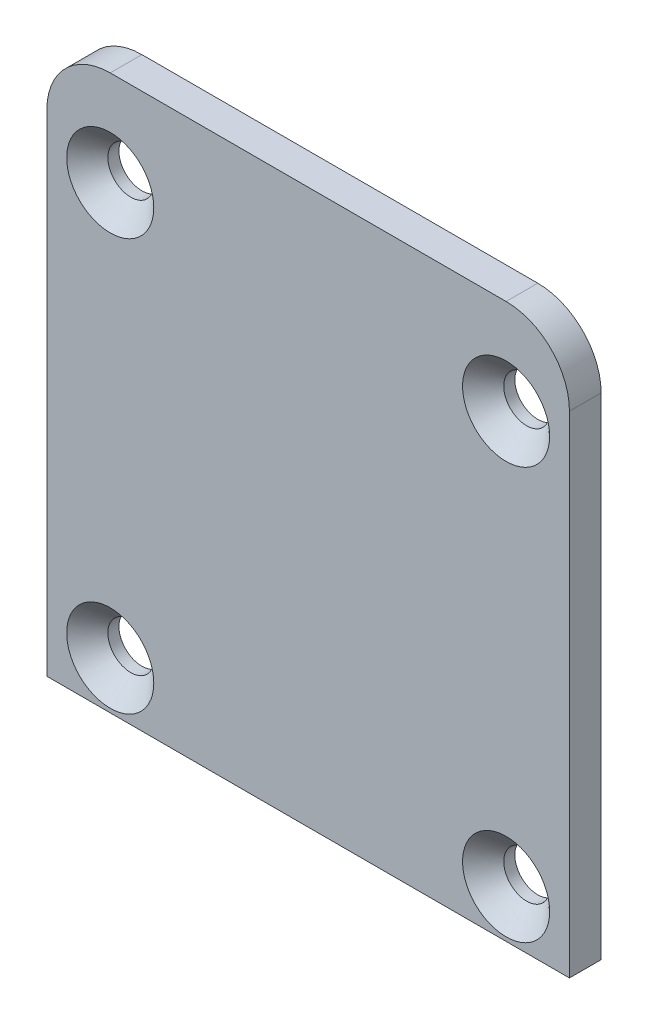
ISO-10303-21;
HEADER;
FILE_DESCRIPTION(('STEP AP214'),'2;1');
FILE_NAME('part.step','',(''),(''),'','','');
FILE_SCHEMA(('AUTOMOTIVE_DESIGN { 1 0 10303 214 1 1 1 1 }'));
ENDSEC;
DATA;
#1=APPLICATION_CONTEXT('core data for automotive mechanical design processes');
#2=APPLICATION_PROTOCOL_DEFINITION('international standard','automotive_design',2000,#1);
#3=PRODUCT_CONTEXT('',#1,'mechanical');
#4=PRODUCT('Part','Part','',(#3));
#5=PRODUCT_RELATED_PRODUCT_CATEGORY('part','',(#4));
#6=PRODUCT_DEFINITION_FORMATION('','',#4);
#7=PRODUCT_DEFINITION_CONTEXT('part definition',#1,'design');
#8=PRODUCT_DEFINITION('design','',#6,#7);
#9=PRODUCT_DEFINITION_SHAPE('','',#8);
#10=(LENGTH_UNIT() NAMED_UNIT(*) SI_UNIT(.MILLI.,.METRE.));
#11=(NAMED_UNIT(*) PLANE_ANGLE_UNIT() SI_UNIT($,.RADIAN.));
#12=(NAMED_UNIT(*) SI_UNIT($,.STERADIAN.) SOLID_ANGLE_UNIT());
#13=UNCERTAINTY_MEASURE_WITH_UNIT(LENGTH_MEASURE(1.E-05),#10,'distance_accuracy_value','');
#14=(GEOMETRIC_REPRESENTATION_CONTEXT(3) GLOBAL_UNCERTAINTY_ASSIGNED_CONTEXT((#13)) GLOBAL_UNIT_ASSIGNED_CONTEXT((#10,
#11,#12)) REPRESENTATION_CONTEXT('',''));
#15=CARTESIAN_POINT('',(0.,0.,0.));
#16=DIRECTION('',(0.,0.,1.));
#17=DIRECTION('',(1.,0.,0.));
#18=AXIS2_PLACEMENT_3D('',#15,#16,#17);
#19=CARTESIAN_POINT('',(-12.5,14.0000000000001,0.));
#20=DIRECTION('',(0.,0.,-1.));
#21=DIRECTION('',(-1.,0.,0.));
#22=AXIS2_PLACEMENT_3D('',#19,#20,#21);
#23=PLANE('',#22);
#24=CARTESIAN_POINT('',(-12.5,-14.,0.));
#25=DIRECTION('',(0.,0.,1.));
#26=DIRECTION('',(1.,0.,0.));
#27=AXIS2_PLACEMENT_3D('',#24,#25,#26);
#28=CIRCLE('',#27,1.45);
#29=CARTESIAN_POINT('',(-11.05,-14.,0.));
#30=VERTEX_POINT('',#29);
#31=EDGE_CURVE('E196',#30,#30,#28,.T.);
#32=ORIENTED_EDGE('',*,*,#31,.T.);
#33=EDGE_LOOP('',(#32));
#34=FACE_BOUND('',#33,.T.);
#35=CARTESIAN_POINT('',(12.5,-14.,0.));
#36=DIRECTION('',(0.,0.,1.));
#37=DIRECTION('',(1.,0.,0.));
#38=AXIS2_PLACEMENT_3D('',#35,#36,#37);
#39=CIRCLE('',#38,1.45);
#40=CARTESIAN_POINT('',(13.95,-14.,0.));
#41=VERTEX_POINT('',#40);
#42=EDGE_CURVE('E203',#41,#41,#39,.T.);
#43=ORIENTED_EDGE('',*,*,#42,.T.);
#44=EDGE_LOOP('',(#43));
#45=FACE_BOUND('',#44,.T.);
#46=CARTESIAN_POINT('',(12.5,12.,0.));
#47=DIRECTION('',(0.,0.,1.));
#48=DIRECTION('',(1.,0.,0.));
#49=AXIS2_PLACEMENT_3D('',#46,#47,#48);
#50=CIRCLE('',#49,1.45);
#51=CARTESIAN_POINT('',(13.95,12.,0.));
#52=VERTEX_POINT('',#51);
#53=EDGE_CURVE('E215',#52,#52,#50,.T.);
#54=ORIENTED_EDGE('',*,*,#53,.T.);
#55=EDGE_LOOP('',(#54));
#56=FACE_BOUND('',#55,.T.);
#57=DIRECTION('',(0.,1.,0.));
#58=VECTOR('',#57,1.);
#59=CARTESIAN_POINT('',(16.5,14.,0.));
#60=LINE('',#59,#58);
#61=CARTESIAN_POINT('',(16.5,-17.,0.));
#62=VERTEX_POINT('',#61);
#63=CARTESIAN_POINT('',(16.5,14.,0.));
#64=VERTEX_POINT('',#63);
#65=EDGE_CURVE('E117',#62,#64,#60,.T.);
#66=ORIENTED_EDGE('',*,*,#65,.F.);
#67=DIRECTION('',(1.,0.,0.));
#68=VECTOR('',#67,1.);
#69=CARTESIAN_POINT('',(-16.5,-17.,0.));
#70=LINE('',#69,#68);
#71=CARTESIAN_POINT('',(-16.5,-17.,0.));
#72=VERTEX_POINT('',#71);
#73=EDGE_CURVE('E78',#72,#62,#70,.T.);
#74=ORIENTED_EDGE('',*,*,#73,.F.);
#75=DIRECTION('',(0.,-1.,0.));
#76=VECTOR('',#75,1.);
#77=CARTESIAN_POINT('',(-16.5,14.0000000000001,0.));
#78=LINE('',#77,#76);
#79=CARTESIAN_POINT('',(-16.5,14.0000000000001,0.));
#80=VERTEX_POINT('',#79);
#81=EDGE_CURVE('E72',#80,#72,#78,.T.);
#82=ORIENTED_EDGE('',*,*,#81,.F.);
#83=CARTESIAN_POINT('',(-12.5,14.0000000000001,0.));
#84=DIRECTION('',(0.,0.,1.));
#85=DIRECTION('',(-1.,0.,0.));
#86=AXIS2_PLACEMENT_3D('',#83,#84,#85);
#87=CIRCLE('',#86,4.);
#88=CARTESIAN_POINT('',(-12.5,18.0000000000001,0.));
#89=VERTEX_POINT('',#88);
#90=EDGE_CURVE('E107',#89,#80,#87,.T.);
#91=ORIENTED_EDGE('',*,*,#90,.F.);
#92=DIRECTION('',(-1.,0.,0.));
#93=VECTOR('',#92,1.);
#94=CARTESIAN_POINT('',(-12.5,18.0000000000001,0.));
#95=LINE('',#94,#93);
#96=CARTESIAN_POINT('',(12.5,18.,0.));
#97=VERTEX_POINT('',#96);
#98=EDGE_CURVE('E123',#97,#89,#95,.T.);
#99=ORIENTED_EDGE('',*,*,#98,.F.);
#100=CARTESIAN_POINT('',(12.5,14.,0.));
#101=DIRECTION('',(0.,0.,1.));
#102=DIRECTION('',(-1.,0.,0.));
#103=AXIS2_PLACEMENT_3D('',#100,#101,#102);
#104=CIRCLE('',#103,4.);
#105=EDGE_CURVE('E120',#64,#97,#104,.T.);
#106=ORIENTED_EDGE('',*,*,#105,.F.);
#107=EDGE_LOOP('',(#66,#74,#82,#91,#99,#106));
#108=FACE_BOUND('',#107,.T.);
#109=CARTESIAN_POINT('',(-12.5,12.0000000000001,0.));
#110=DIRECTION('',(0.,0.,1.));
#111=DIRECTION('',(1.,0.,0.));
#112=AXIS2_PLACEMENT_3D('',#109,#110,#111);
#113=CIRCLE('',#112,1.45);
#114=CARTESIAN_POINT('',(-11.05,12.0000000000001,0.));
#115=VERTEX_POINT('',#114);
#116=EDGE_CURVE('E224',#115,#115,#113,.T.);
#117=ORIENTED_EDGE('',*,*,#116,.T.);
#118=EDGE_LOOP('',(#117));
#119=FACE_BOUND('',#118,.T.);
#120=ADVANCED_FACE('F32',(#34,#45,#56,#108,#119),#23,.T.);
#121=CARTESIAN_POINT('',(16.5,13.9999999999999,2.00000000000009));
#122=DIRECTION('',(-1.,0.,0.));
#123=DIRECTION('',(0.,-1.,0.));
#124=AXIS2_PLACEMENT_3D('',#121,#122,#123);
#125=PLANE('',#124);
#126=ORIENTED_EDGE('',*,*,#65,.T.);
#127=DIRECTION('',(0.,0.,-1.));
#128=VECTOR('',#127,1.);
#129=CARTESIAN_POINT('',(16.5,13.9999999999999,2.00000000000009));
#130=LINE('',#129,#128);
#131=CARTESIAN_POINT('',(16.5,13.9999999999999,2.00000000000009));
#132=VERTEX_POINT('',#131);
#133=EDGE_CURVE('E11',#132,#64,#130,.T.);
#134=ORIENTED_EDGE('',*,*,#133,.F.);
#135=DIRECTION('',(0.,1.,0.));
#136=VECTOR('',#135,1.);
#137=CARTESIAN_POINT('',(16.5,13.9999999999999,2.00000000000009));
#138=LINE('',#137,#136);
#139=CARTESIAN_POINT('',(16.5,-17.,2.));
#140=VERTEX_POINT('',#139);
#141=EDGE_CURVE('E128',#140,#132,#138,.T.);
#142=ORIENTED_EDGE('',*,*,#141,.F.);
#143=DIRECTION('',(0.,0.,-1.));
#144=VECTOR('',#143,1.);
#145=CARTESIAN_POINT('',(16.5,-17.,2.));
#146=LINE('',#145,#144);
#147=EDGE_CURVE('E113',#140,#62,#146,.T.);
#148=ORIENTED_EDGE('',*,*,#147,.T.);
#149=EDGE_LOOP('',(#126,#134,#142,#148));
#150=FACE_BOUND('',#149,.T.);
#151=ADVANCED_FACE('F34',(#150),#125,.F.);
#152=CARTESIAN_POINT('',(12.5,13.9999999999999,2.00000000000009));
#153=DIRECTION('',(0.,0.,-1.));
#154=DIRECTION('',(-1.,0.,0.));
#155=AXIS2_PLACEMENT_3D('',#152,#153,#154);
#156=CYLINDRICAL_SURFACE('',#155,4.);
#157=ORIENTED_EDGE('',*,*,#105,.T.);
#158=DIRECTION('',(0.,0.,-1.));
#159=VECTOR('',#158,1.);
#160=CARTESIAN_POINT('',(12.5,17.9999999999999,2.00000000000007));
#161=LINE('',#160,#159);
#162=CARTESIAN_POINT('',(12.5,17.9999999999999,2.00000000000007));
#163=VERTEX_POINT('',#162);
#164=EDGE_CURVE('E41',#163,#97,#161,.T.);
#165=ORIENTED_EDGE('',*,*,#164,.F.);
#166=CARTESIAN_POINT('',(12.5,13.9999999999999,2.00000000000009));
#167=DIRECTION('',(0.,0.,1.));
#168=DIRECTION('',(-1.,0.,0.));
#169=AXIS2_PLACEMENT_3D('',#166,#167,#168);
#170=CIRCLE('',#169,4.);
#171=EDGE_CURVE('E86',#132,#163,#170,.T.);
#172=ORIENTED_EDGE('',*,*,#171,.F.);
#173=ORIENTED_EDGE('',*,*,#133,.T.);
#174=EDGE_LOOP('',(#157,#165,#172,#173));
#175=FACE_BOUND('',#174,.T.);
#176=ADVANCED_FACE('F158',(#175),#156,.T.);
#177=CARTESIAN_POINT('',(-12.5,18.,2.));
#178=DIRECTION('',(0.,-1.,0.));
#179=DIRECTION('',(0.,0.,-1.));
#180=AXIS2_PLACEMENT_3D('',#177,#178,#179);
#181=PLANE('',#180);
#182=ORIENTED_EDGE('',*,*,#98,.T.);
#183=DIRECTION('',(0.,0.,-1.));
#184=VECTOR('',#183,1.);
#185=CARTESIAN_POINT('',(-12.5,18.,2.));
#186=LINE('',#185,#184);
#187=CARTESIAN_POINT('',(-12.5,18.,2.));
#188=VERTEX_POINT('',#187);
#189=EDGE_CURVE('E108',#188,#89,#186,.T.);
#190=ORIENTED_EDGE('',*,*,#189,.F.);
#191=DIRECTION('',(-1.,0.,0.));
#192=VECTOR('',#191,1.);
#193=CARTESIAN_POINT('',(-12.5,18.,2.));
#194=LINE('',#193,#192);
#195=EDGE_CURVE('E99',#163,#188,#194,.T.);
#196=ORIENTED_EDGE('',*,*,#195,.F.);
#197=ORIENTED_EDGE('',*,*,#164,.T.);
#198=EDGE_LOOP('',(#182,#190,#196,#197));
#199=FACE_BOUND('',#198,.T.);
#200=ADVANCED_FACE('F134',(#199),#181,.F.);
#201=CARTESIAN_POINT('',(-12.5,14.,2.));
#202=DIRECTION('',(0.,0.,-1.));
#203=DIRECTION('',(-1.,0.,0.));
#204=AXIS2_PLACEMENT_3D('',#201,#202,#203);
#205=CYLINDRICAL_SURFACE('',#204,4.);
#206=ORIENTED_EDGE('',*,*,#90,.T.);
#207=DIRECTION('',(0.,0.,-1.));
#208=VECTOR('',#207,1.);
#209=CARTESIAN_POINT('',(-16.5,14.,2.));
#210=LINE('',#209,#208);
#211=CARTESIAN_POINT('',(-16.5,14.,2.));
#212=VERTEX_POINT('',#211);
#213=EDGE_CURVE('E104',#212,#80,#210,.T.);
#214=ORIENTED_EDGE('',*,*,#213,.F.);
#215=CARTESIAN_POINT('',(-12.5,14.,2.));
#216=DIRECTION('',(0.,0.,1.));
#217=DIRECTION('',(-1.,0.,0.));
#218=AXIS2_PLACEMENT_3D('',#215,#216,#217);
#219=CIRCLE('',#218,4.);
#220=EDGE_CURVE('E93',#188,#212,#219,.T.);
#221=ORIENTED_EDGE('',*,*,#220,.F.);
#222=ORIENTED_EDGE('',*,*,#189,.T.);
#223=EDGE_LOOP('',(#206,#214,#221,#222));
#224=FACE_BOUND('',#223,.T.);
#225=ADVANCED_FACE('F105',(#224),#205,.T.);
#226=CARTESIAN_POINT('',(-16.5,14.,2.));
#227=DIRECTION('',(1.,0.,0.));
#228=DIRECTION('',(0.,1.,0.));
#229=AXIS2_PLACEMENT_3D('',#226,#227,#228);
#230=PLANE('',#229);
#231=ORIENTED_EDGE('',*,*,#81,.T.);
#232=DIRECTION('',(0.,0.,-1.));
#233=VECTOR('',#232,1.);
#234=CARTESIAN_POINT('',(-16.5,-17.,1.99999999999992));
#235=LINE('',#234,#233);
#236=CARTESIAN_POINT('',(-16.5,-17.,1.99999999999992));
#237=VERTEX_POINT('',#236);
#238=EDGE_CURVE('E109',#237,#72,#235,.T.);
#239=ORIENTED_EDGE('',*,*,#238,.F.);
#240=DIRECTION('',(0.,-1.,0.));
#241=VECTOR('',#240,1.);
#242=CARTESIAN_POINT('',(-16.5,14.,2.));
#243=LINE('',#242,#241);
#244=EDGE_CURVE('E97',#212,#237,#243,.T.);
#245=ORIENTED_EDGE('',*,*,#244,.F.);
#246=ORIENTED_EDGE('',*,*,#213,.T.);
#247=EDGE_LOOP('',(#231,#239,#245,#246));
#248=FACE_BOUND('',#247,.T.);
#249=ADVANCED_FACE('F111',(#248),#230,.F.);
#250=CARTESIAN_POINT('',(-16.5,-17.,1.99999999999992));
#251=DIRECTION('',(0.,1.,0.));
#252=DIRECTION('',(0.,0.,1.));
#253=AXIS2_PLACEMENT_3D('',#250,#251,#252);
#254=PLANE('',#253);
#255=ORIENTED_EDGE('',*,*,#73,.T.);
#256=ORIENTED_EDGE('',*,*,#147,.F.);
#257=DIRECTION('',(1.,0.,0.));
#258=VECTOR('',#257,1.);
#259=CARTESIAN_POINT('',(-16.5,-17.,1.99999999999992));
#260=LINE('',#259,#258);
#261=EDGE_CURVE('E49',#237,#140,#260,.T.);
#262=ORIENTED_EDGE('',*,*,#261,.F.);
#263=ORIENTED_EDGE('',*,*,#238,.T.);
#264=EDGE_LOOP('',(#255,#256,#262,#263));
#265=FACE_BOUND('',#264,.T.);
#266=ADVANCED_FACE('F141',(#265),#254,.F.);
#267=CARTESIAN_POINT('',(-12.5,14.,2.));
#268=DIRECTION('',(0.,0.,-1.));
#269=DIRECTION('',(-1.,0.,0.));
#270=AXIS2_PLACEMENT_3D('',#267,#268,#269);
#271=PLANE('',#270);
#272=CARTESIAN_POINT('',(-12.5,-14.,2.));
#273=DIRECTION('',(0.,0.,1.));
#274=DIRECTION('',(1.,0.,0.));
#275=AXIS2_PLACEMENT_3D('',#272,#273,#274);
#276=CIRCLE('',#275,2.75);
#277=CARTESIAN_POINT('',(-9.74999999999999,-14.,2.));
#278=VERTEX_POINT('',#277);
#279=EDGE_CURVE('E200',#278,#278,#276,.T.);
#280=ORIENTED_EDGE('',*,*,#279,.F.);
#281=EDGE_LOOP('',(#280));
#282=FACE_BOUND('',#281,.T.);
#283=CARTESIAN_POINT('',(12.5,-14.,2.00000000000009));
#284=DIRECTION('',(0.,0.,1.));
#285=DIRECTION('',(1.,0.,0.));
#286=AXIS2_PLACEMENT_3D('',#283,#284,#285);
#287=CIRCLE('',#286,2.75);
#288=CARTESIAN_POINT('',(15.25,-14.,2.00000000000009));
#289=VERTEX_POINT('',#288);
#290=EDGE_CURVE('E212',#289,#289,#287,.T.);
#291=ORIENTED_EDGE('',*,*,#290,.F.);
#292=EDGE_LOOP('',(#291));
#293=FACE_BOUND('',#292,.T.);
#294=CARTESIAN_POINT('',(12.5,11.9999999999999,2.00000000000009));
#295=DIRECTION('',(0.,0.,1.));
#296=DIRECTION('',(1.,0.,0.));
#297=AXIS2_PLACEMENT_3D('',#294,#295,#296);
#298=CIRCLE('',#297,2.75);
#299=CARTESIAN_POINT('',(15.25,11.9999999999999,2.00000000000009));
#300=VERTEX_POINT('',#299);
#301=EDGE_CURVE('E221',#300,#300,#298,.T.);
#302=ORIENTED_EDGE('',*,*,#301,.F.);
#303=EDGE_LOOP('',(#302));
#304=FACE_BOUND('',#303,.T.);
#305=CARTESIAN_POINT('',(-12.5,12.,2.));
#306=DIRECTION('',(0.,0.,1.));
#307=DIRECTION('',(1.,0.,0.));
#308=AXIS2_PLACEMENT_3D('',#305,#306,#307);
#309=CIRCLE('',#308,2.75);
#310=CARTESIAN_POINT('',(-9.74999999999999,12.,2.));
#311=VERTEX_POINT('',#310);
#312=EDGE_CURVE('E121',#311,#311,#309,.T.);
#313=ORIENTED_EDGE('',*,*,#312,.F.);
#314=EDGE_LOOP('',(#313));
#315=FACE_BOUND('',#314,.T.);
#316=ORIENTED_EDGE('',*,*,#141,.T.);
#317=ORIENTED_EDGE('',*,*,#171,.T.);
#318=ORIENTED_EDGE('',*,*,#195,.T.);
#319=ORIENTED_EDGE('',*,*,#220,.T.);
#320=ORIENTED_EDGE('',*,*,#244,.T.);
#321=ORIENTED_EDGE('',*,*,#261,.T.);
#322=EDGE_LOOP('',(#316,#317,#318,#319,#320,#321));
#323=FACE_BOUND('',#322,.T.);
#324=ADVANCED_FACE('F95',(#282,#293,#304,#315,#323),#271,.F.);
#325=CARTESIAN_POINT('',(-12.5,12.,2.));
#326=DIRECTION('',(0.,0.,1.));
#327=DIRECTION('',(1.,0.,0.));
#328=AXIS2_PLACEMENT_3D('',#325,#326,#327);
#329=CONICAL_SURFACE('',#328,2.75,0.785398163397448);
#330=CARTESIAN_POINT('',(-12.5,12.0000000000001,0.700000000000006));
#331=DIRECTION('',(0.,0.,1.));
#332=DIRECTION('',(1.,0.,0.));
#333=AXIS2_PLACEMENT_3D('',#330,#331,#332);
#334=CIRCLE('',#333,1.45);
#335=CARTESIAN_POINT('',(-11.05,12.0000000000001,0.700000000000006));
#336=VERTEX_POINT('',#335);
#337=EDGE_CURVE('E227',#336,#336,#334,.T.);
#338=ORIENTED_EDGE('',*,*,#337,.F.);
#339=EDGE_LOOP('',(#338));
#340=FACE_BOUND('',#339,.T.);
#341=ORIENTED_EDGE('',*,*,#312,.T.);
#342=EDGE_LOOP('',(#341));
#343=FACE_BOUND('',#342,.T.);
#344=ADVANCED_FACE('F148',(#340,#343),#329,.F.);
#345=CARTESIAN_POINT('',(-12.5,12.,2.));
#346=DIRECTION('',(0.,0.,1.));
#347=DIRECTION('',(1.,0.,0.));
#348=AXIS2_PLACEMENT_3D('',#345,#346,#347);
#349=CYLINDRICAL_SURFACE('',#348,1.45);
#350=ORIENTED_EDGE('',*,*,#116,.F.);
#351=EDGE_LOOP('',(#350));
#352=FACE_BOUND('',#351,.T.);
#353=ORIENTED_EDGE('',*,*,#337,.T.);
#354=EDGE_LOOP('',(#353));
#355=FACE_BOUND('',#354,.T.);
#356=ADVANCED_FACE('F164',(#352,#355),#349,.F.);
#357=CARTESIAN_POINT('',(12.5,11.9999999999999,2.00000000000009));
#358=DIRECTION('',(0.,0.,1.));
#359=DIRECTION('',(1.,0.,0.));
#360=AXIS2_PLACEMENT_3D('',#357,#358,#359);
#361=CONICAL_SURFACE('',#360,2.75,0.785398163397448);
#362=CARTESIAN_POINT('',(12.5,12.,0.700000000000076));
#363=DIRECTION('',(0.,0.,1.));
#364=DIRECTION('',(1.,0.,0.));
#365=AXIS2_PLACEMENT_3D('',#362,#363,#364);
#366=CIRCLE('',#365,1.45);
#367=CARTESIAN_POINT('',(13.95,12.,0.700000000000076));
#368=VERTEX_POINT('',#367);
#369=EDGE_CURVE('E218',#368,#368,#366,.T.);
#370=ORIENTED_EDGE('',*,*,#369,.F.);
#371=EDGE_LOOP('',(#370));
#372=FACE_BOUND('',#371,.T.);
#373=ORIENTED_EDGE('',*,*,#301,.T.);
#374=EDGE_LOOP('',(#373));
#375=FACE_BOUND('',#374,.T.);
#376=ADVANCED_FACE('F168',(#372,#375),#361,.F.);
#377=CARTESIAN_POINT('',(12.5,11.9999999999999,2.00000000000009));
#378=DIRECTION('',(0.,0.,1.));
#379=DIRECTION('',(1.,0.,0.));
#380=AXIS2_PLACEMENT_3D('',#377,#378,#379);
#381=CYLINDRICAL_SURFACE('',#380,1.45);
#382=ORIENTED_EDGE('',*,*,#53,.F.);
#383=EDGE_LOOP('',(#382));
#384=FACE_BOUND('',#383,.T.);
#385=ORIENTED_EDGE('',*,*,#369,.T.);
#386=EDGE_LOOP('',(#385));
#387=FACE_BOUND('',#386,.T.);
#388=ADVANCED_FACE('F172',(#384,#387),#381,.F.);
#389=CARTESIAN_POINT('',(12.5,-14.,2.00000000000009));
#390=DIRECTION('',(0.,0.,1.));
#391=DIRECTION('',(1.,0.,0.));
#392=AXIS2_PLACEMENT_3D('',#389,#390,#391);
#393=CONICAL_SURFACE('',#392,2.75,0.785398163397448);
#394=CARTESIAN_POINT('',(12.5,-14.,0.700000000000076));
#395=DIRECTION('',(0.,0.,1.));
#396=DIRECTION('',(1.,0.,0.));
#397=AXIS2_PLACEMENT_3D('',#394,#395,#396);
#398=CIRCLE('',#397,1.45);
#399=CARTESIAN_POINT('',(13.95,-14.,0.700000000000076));
#400=VERTEX_POINT('',#399);
#401=EDGE_CURVE('E209',#400,#400,#398,.T.);
#402=ORIENTED_EDGE('',*,*,#401,.F.);
#403=EDGE_LOOP('',(#402));
#404=FACE_BOUND('',#403,.T.);
#405=ORIENTED_EDGE('',*,*,#290,.T.);
#406=EDGE_LOOP('',(#405));
#407=FACE_BOUND('',#406,.T.);
#408=ADVANCED_FACE('F176',(#404,#407),#393,.F.);
#409=CARTESIAN_POINT('',(12.5,-14.,2.00000000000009));
#410=DIRECTION('',(0.,0.,1.));
#411=DIRECTION('',(1.,0.,0.));
#412=AXIS2_PLACEMENT_3D('',#409,#410,#411);
#413=CYLINDRICAL_SURFACE('',#412,1.45);
#414=ORIENTED_EDGE('',*,*,#42,.F.);
#415=EDGE_LOOP('',(#414));
#416=FACE_BOUND('',#415,.T.);
#417=ORIENTED_EDGE('',*,*,#401,.T.);
#418=EDGE_LOOP('',(#417));
#419=FACE_BOUND('',#418,.T.);
#420=ADVANCED_FACE('F180',(#416,#419),#413,.F.);
#421=CARTESIAN_POINT('',(-12.5,-14.,2.));
#422=DIRECTION('',(0.,0.,1.));
#423=DIRECTION('',(1.,0.,0.));
#424=AXIS2_PLACEMENT_3D('',#421,#422,#423);
#425=CONICAL_SURFACE('',#424,2.75,0.785398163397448);
#426=CARTESIAN_POINT('',(-12.5,-14.,0.700000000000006));
#427=DIRECTION('',(0.,0.,1.));
#428=DIRECTION('',(1.,0.,0.));
#429=AXIS2_PLACEMENT_3D('',#426,#427,#428);
#430=CIRCLE('',#429,1.45);
#431=CARTESIAN_POINT('',(-11.05,-14.,0.700000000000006));
#432=VERTEX_POINT('',#431);
#433=EDGE_CURVE('E199',#432,#432,#430,.T.);
#434=ORIENTED_EDGE('',*,*,#433,.F.);
#435=EDGE_LOOP('',(#434));
#436=FACE_BOUND('',#435,.T.);
#437=ORIENTED_EDGE('',*,*,#279,.T.);
#438=EDGE_LOOP('',(#437));
#439=FACE_BOUND('',#438,.T.);
#440=ADVANCED_FACE('F184',(#436,#439),#425,.F.);
#441=CARTESIAN_POINT('',(-12.5,-14.,2.));
#442=DIRECTION('',(0.,0.,1.));
#443=DIRECTION('',(1.,0.,0.));
#444=AXIS2_PLACEMENT_3D('',#441,#442,#443);
#445=CYLINDRICAL_SURFACE('',#444,1.45);
#446=ORIENTED_EDGE('',*,*,#31,.F.);
#447=EDGE_LOOP('',(#446));
#448=FACE_BOUND('',#447,.T.);
#449=ORIENTED_EDGE('',*,*,#433,.T.);
#450=EDGE_LOOP('',(#449));
#451=FACE_BOUND('',#450,.T.);
#452=ADVANCED_FACE('F188',(#448,#451),#445,.F.);
#453=CLOSED_SHELL('',(#120,#151,#176,#200,#225,#249,#266,#324,#344,#356,#376,#388,#408,#420,
#440,#452));
#454=MANIFOLD_SOLID_BREP('B2',#453);
#455=ADVANCED_BREP_SHAPE_REPRESENTATION('',(#18,#454),#14);
#456=SHAPE_DEFINITION_REPRESENTATION(#9,#455);
ENDSEC;
END-ISO-10303-21;
